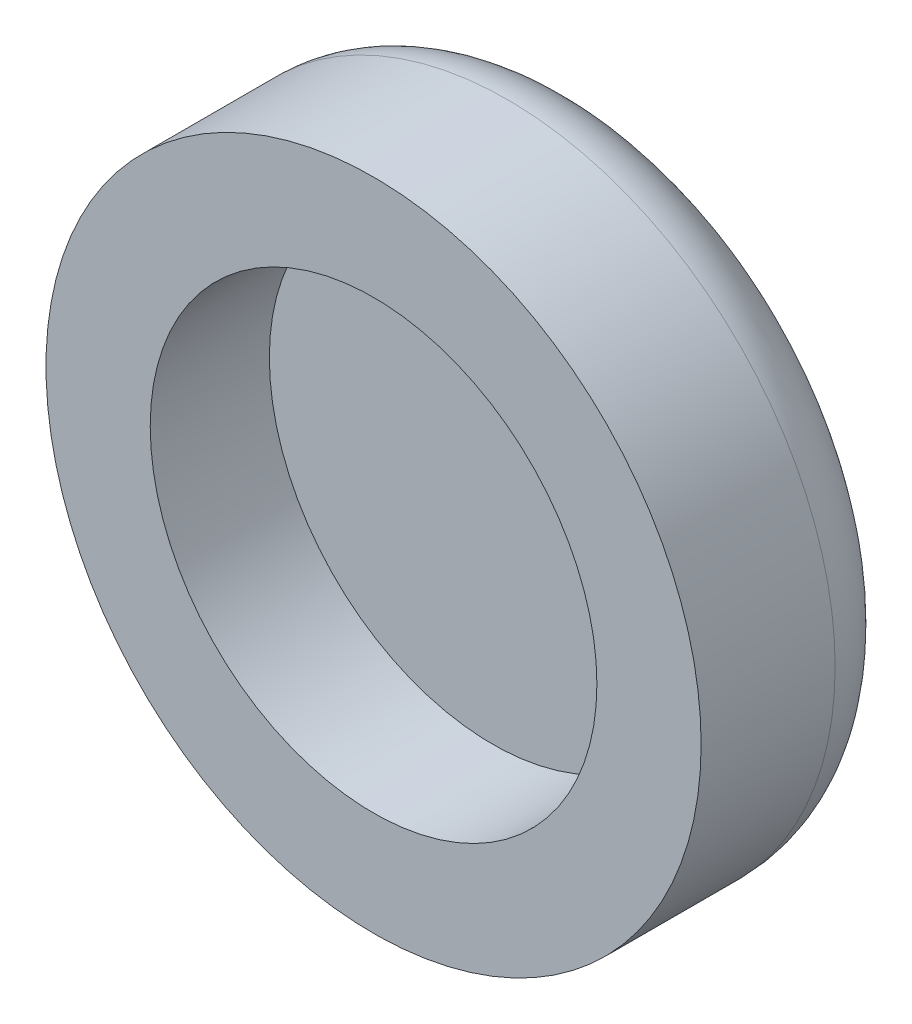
ISO-10303-21;
HEADER;
FILE_DESCRIPTION(('STEP AP214'),'2;1');
FILE_NAME('part.step','',(''),(''),'','','');
FILE_SCHEMA(('AUTOMOTIVE_DESIGN { 1 0 10303 214 1 1 1 1 }'));
ENDSEC;
DATA;
#1=APPLICATION_CONTEXT('core data for automotive mechanical design processes');
#2=APPLICATION_PROTOCOL_DEFINITION('international standard','automotive_design',2000,#1);
#3=PRODUCT_CONTEXT('',#1,'mechanical');
#4=PRODUCT('Part','Part','',(#3));
#5=PRODUCT_RELATED_PRODUCT_CATEGORY('part','',(#4));
#6=PRODUCT_DEFINITION_FORMATION('','',#4);
#7=PRODUCT_DEFINITION_CONTEXT('part definition',#1,'design');
#8=PRODUCT_DEFINITION('design','',#6,#7);
#9=PRODUCT_DEFINITION_SHAPE('','',#8);
#10=(LENGTH_UNIT() NAMED_UNIT(*) SI_UNIT(.MILLI.,.METRE.));
#11=(NAMED_UNIT(*) PLANE_ANGLE_UNIT() SI_UNIT($,.RADIAN.));
#12=(NAMED_UNIT(*) SI_UNIT($,.STERADIAN.) SOLID_ANGLE_UNIT());
#13=UNCERTAINTY_MEASURE_WITH_UNIT(LENGTH_MEASURE(1.E-05),#10,'distance_accuracy_value','');
#14=(GEOMETRIC_REPRESENTATION_CONTEXT(3) GLOBAL_UNCERTAINTY_ASSIGNED_CONTEXT((#13)) GLOBAL_UNIT_ASSIGNED_CONTEXT((#10,
#11,#12)) REPRESENTATION_CONTEXT('',''));
#15=CARTESIAN_POINT('',(0.,0.,0.));
#16=DIRECTION('',(0.,0.,1.));
#17=DIRECTION('',(1.,0.,0.));
#18=AXIS2_PLACEMENT_3D('',#15,#16,#17);
#19=CARTESIAN_POINT('',(0.,0.,3.));
#20=DIRECTION('',(0.,0.,-1.));
#21=DIRECTION('',(-1.,0.,0.));
#22=AXIS2_PLACEMENT_3D('',#19,#20,#21);
#23=PLANE('',#22);
#24=CARTESIAN_POINT('',(0.,0.,3.));
#25=DIRECTION('',(0.,0.,-1.));
#26=DIRECTION('',(-1.,0.,0.));
#27=AXIS2_PLACEMENT_3D('',#24,#25,#26);
#28=CIRCLE('',#27,7.5);
#29=CARTESIAN_POINT('',(-7.5,0.,3.));
#30=VERTEX_POINT('',#29);
#31=EDGE_CURVE('E16',#30,#30,#28,.F.);
#32=ORIENTED_EDGE('',*,*,#31,.T.);
#33=EDGE_LOOP('',(#32));
#34=FACE_BOUND('',#33,.T.);
#35=ADVANCED_FACE('F13',(#34),#23,.F.);
#36=CARTESIAN_POINT('',(0.,0.,7.));
#37=DIRECTION('',(0.,0.,-1.));
#38=DIRECTION('',(-1.,0.,0.));
#39=AXIS2_PLACEMENT_3D('',#36,#37,#38);
#40=CYLINDRICAL_SURFACE('',#39,7.5);
#41=CARTESIAN_POINT('',(0.,0.,7.));
#42=DIRECTION('',(0.,0.,-1.));
#43=DIRECTION('',(-1.,0.,0.));
#44=AXIS2_PLACEMENT_3D('',#41,#42,#43);
#45=CIRCLE('',#44,7.5);
#46=CARTESIAN_POINT('',(-7.5,0.,7.));
#47=VERTEX_POINT('',#46);
#48=EDGE_CURVE('E54',#47,#47,#45,.F.);
#49=ORIENTED_EDGE('',*,*,#48,.T.);
#50=EDGE_LOOP('',(#49));
#51=FACE_BOUND('',#50,.T.);
#52=ORIENTED_EDGE('',*,*,#31,.F.);
#53=EDGE_LOOP('',(#52));
#54=FACE_BOUND('',#53,.T.);
#55=ADVANCED_FACE('F62',(#51,#54),#40,.F.);
#56=CARTESIAN_POINT('',(0.,0.,0.));
#57=DIRECTION('',(0.,0.,-1.));
#58=DIRECTION('',(-1.,0.,0.));
#59=AXIS2_PLACEMENT_3D('',#56,#57,#58);
#60=PLANE('',#59);
#61=CARTESIAN_POINT('',(0.,0.,0.));
#62=DIRECTION('',(0.,0.,1.));
#63=DIRECTION('',(1.,0.,0.));
#64=AXIS2_PLACEMENT_3D('',#61,#62,#63);
#65=CIRCLE('',#64,8.5);
#66=CARTESIAN_POINT('',(8.5,0.,0.));
#67=VERTEX_POINT('',#66);
#68=EDGE_CURVE('E25',#67,#67,#65,.T.);
#69=ORIENTED_EDGE('',*,*,#68,.F.);
#70=EDGE_LOOP('',(#69));
#71=FACE_BOUND('',#70,.T.);
#72=ADVANCED_FACE('F64',(#71),#60,.T.);
#73=CARTESIAN_POINT('',(0.,0.,7.));
#74=DIRECTION('',(0.,0.,-1.));
#75=DIRECTION('',(-1.,0.,0.));
#76=AXIS2_PLACEMENT_3D('',#73,#74,#75);
#77=PLANE('',#76);
#78=ORIENTED_EDGE('',*,*,#48,.F.);
#79=EDGE_LOOP('',(#78));
#80=FACE_BOUND('',#79,.T.);
#81=CARTESIAN_POINT('',(0.,0.,7.));
#82=DIRECTION('',(0.,0.,1.));
#83=DIRECTION('',(1.,0.,0.));
#84=AXIS2_PLACEMENT_3D('',#81,#82,#83);
#85=CIRCLE('',#84,11.);
#86=CARTESIAN_POINT('',(11.,0.,7.));
#87=VERTEX_POINT('',#86);
#88=EDGE_CURVE('E20',#87,#87,#85,.F.);
#89=ORIENTED_EDGE('',*,*,#88,.F.);
#90=EDGE_LOOP('',(#89));
#91=FACE_BOUND('',#90,.T.);
#92=ADVANCED_FACE('F41',(#80,#91),#77,.F.);
#93=CARTESIAN_POINT('',(0.,0.,2.5));
#94=DIRECTION('',(0.,0.,-1.));
#95=DIRECTION('',(-1.,0.,0.));
#96=AXIS2_PLACEMENT_3D('',#93,#94,#95);
#97=TOROIDAL_SURFACE('',#96,8.5,2.5);
#98=ORIENTED_EDGE('',*,*,#68,.T.);
#99=EDGE_LOOP('',(#98));
#100=FACE_BOUND('',#99,.T.);
#101=CARTESIAN_POINT('',(0.,0.,2.5));
#102=DIRECTION('',(0.,0.,1.));
#103=DIRECTION('',(1.,0.,0.));
#104=AXIS2_PLACEMENT_3D('',#101,#102,#103);
#105=CIRCLE('',#104,11.);
#106=CARTESIAN_POINT('',(11.,0.,2.5));
#107=VERTEX_POINT('',#106);
#108=EDGE_CURVE('E9',#107,#107,#105,.T.);
#109=ORIENTED_EDGE('',*,*,#108,.F.);
#110=EDGE_LOOP('',(#109));
#111=FACE_BOUND('',#110,.T.);
#112=ADVANCED_FACE('F35',(#100,#111),#97,.T.);
#113=CARTESIAN_POINT('',(0.,0.,0.));
#114=DIRECTION('',(0.,0.,1.));
#115=DIRECTION('',(1.,0.,0.));
#116=AXIS2_PLACEMENT_3D('',#113,#114,#115);
#117=CYLINDRICAL_SURFACE('',#116,11.);
#118=ORIENTED_EDGE('',*,*,#108,.T.);
#119=EDGE_LOOP('',(#118));
#120=FACE_BOUND('',#119,.T.);
#121=ORIENTED_EDGE('',*,*,#88,.T.);
#122=EDGE_LOOP('',(#121));
#123=FACE_BOUND('',#122,.T.);
#124=ADVANCED_FACE('F40',(#120,#123),#117,.T.);
#125=CLOSED_SHELL('',(#35,#55,#72,#92,#112,#124));
#126=MANIFOLD_SOLID_BREP('B1',#125);
#127=ADVANCED_BREP_SHAPE_REPRESENTATION('',(#18,#126),#14);
#128=SHAPE_DEFINITION_REPRESENTATION(#9,#127);
ENDSEC;
END-ISO-10303-21;
